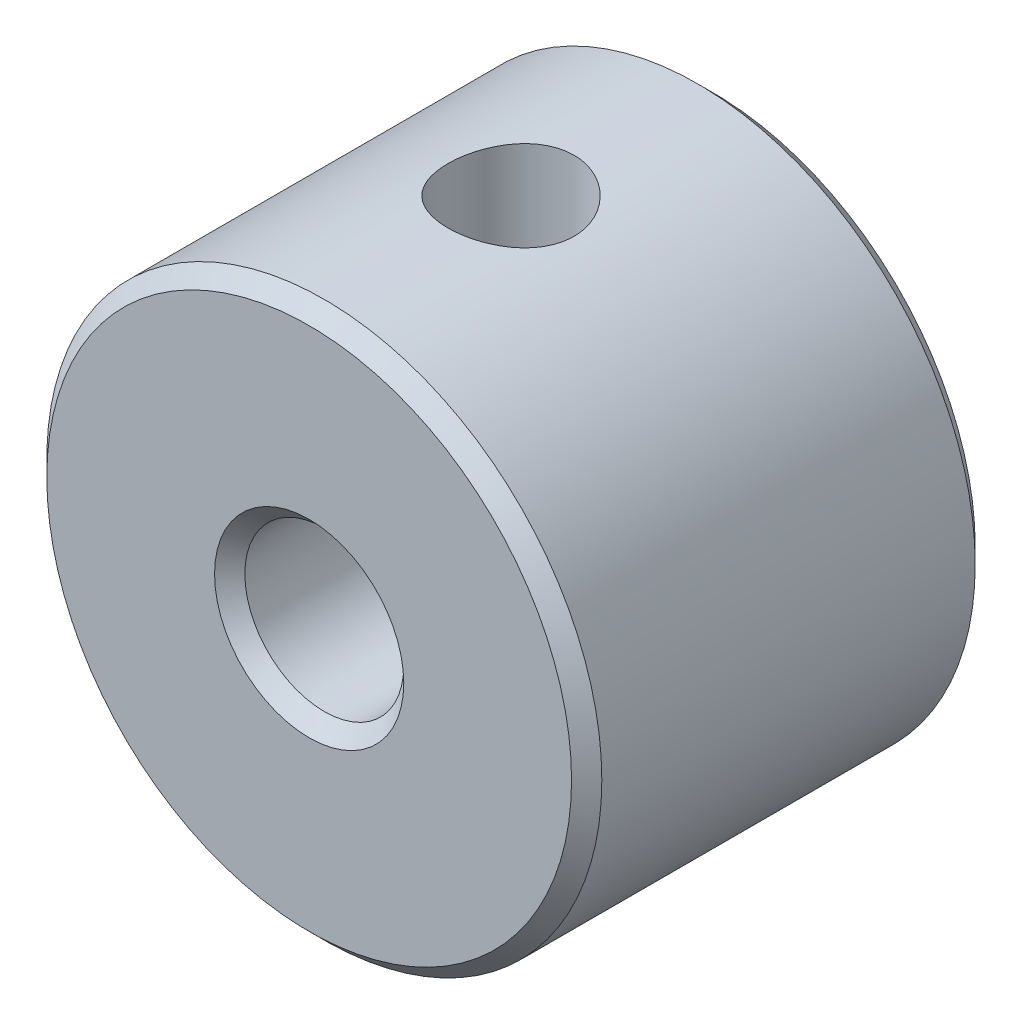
ISO-10303-21;
HEADER;
FILE_DESCRIPTION(('STEP AP214'),'2;1');
FILE_NAME('part.step','',(''),(''),'','','');
FILE_SCHEMA(('AUTOMOTIVE_DESIGN { 1 0 10303 214 1 1 1 1 }'));
ENDSEC;
DATA;
#1=APPLICATION_CONTEXT('core data for automotive mechanical design processes');
#2=APPLICATION_PROTOCOL_DEFINITION('international standard','automotive_design',2000,#1);
#3=PRODUCT_CONTEXT('',#1,'mechanical');
#4=PRODUCT('Part','Part','',(#3));
#5=PRODUCT_RELATED_PRODUCT_CATEGORY('part','',(#4));
#6=PRODUCT_DEFINITION_FORMATION('','',#4);
#7=PRODUCT_DEFINITION_CONTEXT('part definition',#1,'design');
#8=PRODUCT_DEFINITION('design','',#6,#7);
#9=PRODUCT_DEFINITION_SHAPE('','',#8);
#10=(LENGTH_UNIT() NAMED_UNIT(*) SI_UNIT(.MILLI.,.METRE.));
#11=(NAMED_UNIT(*) PLANE_ANGLE_UNIT() SI_UNIT($,.RADIAN.));
#12=(NAMED_UNIT(*) SI_UNIT($,.STERADIAN.) SOLID_ANGLE_UNIT());
#13=UNCERTAINTY_MEASURE_WITH_UNIT(LENGTH_MEASURE(1.E-05),#10,'distance_accuracy_value','');
#14=(GEOMETRIC_REPRESENTATION_CONTEXT(3) GLOBAL_UNCERTAINTY_ASSIGNED_CONTEXT((#13)) GLOBAL_UNIT_ASSIGNED_CONTEXT((#10,
#11,#12)) REPRESENTATION_CONTEXT('',''));
#15=CARTESIAN_POINT('',(0.,0.,0.));
#16=DIRECTION('',(0.,0.,1.));
#17=DIRECTION('',(1.,0.,0.));
#18=AXIS2_PLACEMENT_3D('',#15,#16,#17);
#19=CARTESIAN_POINT('',(0.,0.,8.));
#20=DIRECTION('',(0.,0.,-1.));
#21=DIRECTION('',(-1.,0.,0.));
#22=AXIS2_PLACEMENT_3D('',#19,#20,#21);
#23=CYLINDRICAL_SURFACE('',#22,5.5);
#24=CARTESIAN_POINT('',(0.,0.,0.300000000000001));
#25=DIRECTION('',(0.,0.,1.));
#26=DIRECTION('',(1.,0.,0.));
#27=AXIS2_PLACEMENT_3D('',#24,#25,#26);
#28=CIRCLE('',#27,5.5);
#29=CARTESIAN_POINT('',(5.5,0.,0.300000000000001));
#30=VERTEX_POINT('',#29);
#31=EDGE_CURVE('E41',#30,#30,#28,.T.);
#32=ORIENTED_EDGE('',*,*,#31,.T.);
#33=EDGE_LOOP('',(#32));
#34=FACE_BOUND('',#33,.T.);
#35=CARTESIAN_POINT('',(0.,0.,7.7));
#36=DIRECTION('',(0.,0.,1.));
#37=DIRECTION('',(1.,0.,0.));
#38=AXIS2_PLACEMENT_3D('',#35,#36,#37);
#39=CIRCLE('',#38,5.5);
#40=CARTESIAN_POINT('',(5.5,0.,7.7));
#41=VERTEX_POINT('',#40);
#42=EDGE_CURVE('E45',#41,#41,#39,.F.);
#43=ORIENTED_EDGE('',*,*,#42,.T.);
#44=EDGE_LOOP('',(#43));
#45=FACE_BOUND('',#44,.T.);
#46=CARTESIAN_POINT('',(0.,5.5,2.75));
#47=CARTESIAN_POINT('',(-0.0692591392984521,5.49999873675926,2.75000226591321));
#48=CARTESIAN_POINT('',(-0.138545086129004,5.49867854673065,2.75577561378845));
#49=CARTESIAN_POINT('',(-0.275144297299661,5.493539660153,2.77868973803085));
#50=CARTESIAN_POINT('',(-0.342456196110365,5.48971927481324,2.79583819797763));
#51=CARTESIAN_POINT('',(-0.473113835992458,5.48000476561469,2.84093402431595));
#52=CARTESIAN_POINT('',(-0.536463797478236,5.47411289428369,2.86886966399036));
#53=CARTESIAN_POINT('',(-0.657576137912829,5.46088910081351,2.93470855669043));
#54=CARTESIAN_POINT('',(-0.71533857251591,5.45355719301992,2.97261171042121));
#55=CARTESIAN_POINT('',(-0.824633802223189,5.4381132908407,3.05800102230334));
#56=CARTESIAN_POINT('',(-0.876056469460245,5.42999098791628,3.1056262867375));
#57=CARTESIAN_POINT('',(-0.970256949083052,5.41395325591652,3.20880948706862));
#58=CARTESIAN_POINT('',(-1.01303394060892,5.40603784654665,3.26436817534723));
#59=CARTESIAN_POINT('',(-1.08922299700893,5.39120791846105,3.38266602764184));
#60=CARTESIAN_POINT('',(-1.12251627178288,5.38430657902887,3.44548349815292));
#61=CARTESIAN_POINT('',(-1.17803034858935,5.37243480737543,3.57600475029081));
#62=CARTESIAN_POINT('',(-1.20025258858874,5.36746412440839,3.64370789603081));
#63=CARTESIAN_POINT('',(-1.23262674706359,5.36012172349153,3.78087959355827));
#64=CARTESIAN_POINT('',(-1.24297446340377,5.3577078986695,3.85029963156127));
#65=CARTESIAN_POINT('',(-1.25191494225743,5.35562617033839,3.98992911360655));
#66=CARTESIAN_POINT('',(-1.25050926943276,5.35595790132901,4.06013845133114));
#67=CARTESIAN_POINT('',(-1.23614008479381,5.35929175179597,4.19788644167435));
#68=CARTESIAN_POINT('',(-1.22340552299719,5.36224097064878,4.26545045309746));
#69=CARTESIAN_POINT('',(-1.18710342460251,5.37039368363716,4.39745724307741));
#70=CARTESIAN_POINT('',(-1.16353523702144,5.3755973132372,4.46189983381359));
#71=CARTESIAN_POINT('',(-1.10602867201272,5.38772371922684,4.58647033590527));
#72=CARTESIAN_POINT('',(-1.07200356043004,5.39466077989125,4.64655675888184));
#73=CARTESIAN_POINT('',(-0.994609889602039,5.40946384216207,4.76025127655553));
#74=CARTESIAN_POINT('',(-0.951239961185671,5.41732997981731,4.81385842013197));
#75=CARTESIAN_POINT('',(-0.855182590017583,5.43333076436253,4.91438928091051));
#76=CARTESIAN_POINT('',(-0.802300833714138,5.44146738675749,4.96112721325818));
#77=CARTESIAN_POINT('',(-0.689356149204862,5.45692512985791,5.04510294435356));
#78=CARTESIAN_POINT('',(-0.629293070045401,5.46424623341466,5.08234054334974));
#79=CARTESIAN_POINT('',(-0.503453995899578,5.47727487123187,5.14631019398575));
#80=CARTESIAN_POINT('',(-0.437664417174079,5.48297842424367,5.17301638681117));
#81=CARTESIAN_POINT('',(-0.302372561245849,5.49209994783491,5.21494200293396));
#82=CARTESIAN_POINT('',(-0.23287086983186,5.49551827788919,5.23016323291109));
#83=CARTESIAN_POINT('',(-0.0937199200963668,5.4996325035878,5.24841311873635));
#84=CARTESIAN_POINT('',(-0.0241055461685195,5.50038500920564,5.25169534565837));
#85=CARTESIAN_POINT('',(0.114676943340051,5.49924211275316,5.24666348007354));
#86=CARTESIAN_POINT('',(0.183845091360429,5.49734690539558,5.23835024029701));
#87=CARTESIAN_POINT('',(0.318920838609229,5.49115740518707,5.21057341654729));
#88=CARTESIAN_POINT('',(0.384857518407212,5.4868920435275,5.19124422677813));
#89=CARTESIAN_POINT('',(0.512551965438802,5.47644030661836,5.14213448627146));
#90=CARTESIAN_POINT('',(0.574309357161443,5.47025375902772,5.11235299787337));
#91=CARTESIAN_POINT('',(0.692930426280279,5.45650716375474,5.04266542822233));
#92=CARTESIAN_POINT('',(0.749705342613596,5.4489276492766,5.00261218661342));
#93=CARTESIAN_POINT('',(0.85581886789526,5.43327304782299,4.9137103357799));
#94=CARTESIAN_POINT('',(0.905156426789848,5.42519789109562,4.86486048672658));
#95=CARTESIAN_POINT('',(0.996008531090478,5.40926438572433,4.75858451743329));
#96=CARTESIAN_POINT('',(1.03734683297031,5.40141360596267,4.7010063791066));
#97=CARTESIAN_POINT('',(1.10976907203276,5.3870011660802,4.57957680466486));
#98=CARTESIAN_POINT('',(1.14085346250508,5.38043944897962,4.51572564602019));
#99=CARTESIAN_POINT('',(1.19166798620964,5.36941374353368,4.38390976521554));
#100=CARTESIAN_POINT('',(1.21146358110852,5.3649376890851,4.31597133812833));
#101=CARTESIAN_POINT('',(1.23932629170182,5.35857055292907,4.17761654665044));
#102=CARTESIAN_POINT('',(1.24739545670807,5.35667901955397,4.1072006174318));
#103=CARTESIAN_POINT('',(1.25148369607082,5.35572514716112,3.96767069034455));
#104=CARTESIAN_POINT('',(1.24778274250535,5.35659707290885,3.8985652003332));
#105=CARTESIAN_POINT('',(1.22906557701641,5.36092234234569,3.76199054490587));
#106=CARTESIAN_POINT('',(1.21404952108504,5.36437565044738,3.69452135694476));
#107=CARTESIAN_POINT('',(1.17326846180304,5.37344130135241,3.56337830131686));
#108=CARTESIAN_POINT('',(1.14754728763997,5.37904483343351,3.49969015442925));
#109=CARTESIAN_POINT('',(1.0861226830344,5.39178236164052,3.3774926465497));
#110=CARTESIAN_POINT('',(1.05041811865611,5.39891653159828,3.31898387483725));
#111=CARTESIAN_POINT('',(0.969124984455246,5.41410553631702,3.20743278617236));
#112=CARTESIAN_POINT('',(0.92333822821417,5.42217702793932,3.15453713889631));
#113=CARTESIAN_POINT('',(0.823578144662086,5.43822274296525,3.05708840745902));
#114=CARTESIAN_POINT('',(0.769602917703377,5.44619694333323,3.01253726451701));
#115=CARTESIAN_POINT('',(0.654070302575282,5.46128466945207,2.93243096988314));
#116=CARTESIAN_POINT('',(0.592415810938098,5.46838430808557,2.89701308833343));
#117=CARTESIAN_POINT('',(0.463877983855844,5.48078202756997,2.83710001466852));
#118=CARTESIAN_POINT('',(0.396998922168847,5.48608156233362,2.81259600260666));
#119=CARTESIAN_POINT('',(0.27508153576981,5.49337797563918,2.77938604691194));
#120=CARTESIAN_POINT('',(0.220684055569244,5.49584542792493,2.76838800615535));
#121=CARTESIAN_POINT('',(0.110863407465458,5.49915690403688,2.75369426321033));
#122=CARTESIAN_POINT('',(0.0554402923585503,5.50000101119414,2.74999818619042));
#123=CARTESIAN_POINT('',(0.,5.5,2.75));
#124=B_SPLINE_CURVE_WITH_KNOTS('',3,(#46,#47,#48,#49,#50,#51,#52,#53,#54,#55,#56,#57,#58,#59,
#60,#61,#62,#63,#64,#65,#66,#67,#68,#69,#70,#71,#72,#73,#74,#75,#76,#77,#78,#79,#80,#81,#82,#83,
#84,#85,#86,#87,#88,#89,#90,#91,#92,#93,#94,#95,#96,#97,#98,#99,#100,#101,#102,#103,#104,#105,
#106,#107,#108,#109,#110,#111,#112,#113,#114,#115,#116,#117,#118,#119,#120,#121,#122,#123),
.UNSPECIFIED.,.T.,.F.,(4,2,2,2,2,2,2,2,2,2,2,2,2,2,2,2,2,2,2,2,2,2,2,2,2,2,2,2,2,2,2,2,2,2,2,2,
2,2,4),(0.,0.207574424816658,0.415289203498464,0.622778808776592,0.830266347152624,
1.04096194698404,1.25167754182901,1.46492681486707,1.67814838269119,1.88780122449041,
2.09742615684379,2.30290857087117,2.50840333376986,2.71565078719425,2.92292862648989,
3.13505765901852,3.34719115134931,3.55984232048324,3.77246003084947,3.98053470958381,
4.18859408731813,4.39416788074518,4.59976012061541,4.80848064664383,5.01723061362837,
5.23015660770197,5.44307318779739,5.65474220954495,5.86637423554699,6.07301021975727,
6.27964335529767,6.48543868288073,6.69125739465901,6.90155512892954,7.11190172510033,
7.32524638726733,7.53841832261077,7.70458523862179,7.87074362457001),.UNSPECIFIED.);
#125=CARTESIAN_POINT('',(0.,5.5,2.75));
#126=VERTEX_POINT('',#125);
#127=EDGE_CURVE('E62',#126,#126,#124,.T.);
#128=ORIENTED_EDGE('',*,*,#127,.F.);
#129=EDGE_LOOP('',(#128));
#130=FACE_BOUND('',#129,.T.);
#131=ADVANCED_FACE('F30',(#34,#45,#130),#23,.T.);
#132=CARTESIAN_POINT('',(0.,0.,8.));
#133=DIRECTION('',(0.,0.,-1.));
#134=DIRECTION('',(-1.,0.,0.));
#135=AXIS2_PLACEMENT_3D('',#132,#133,#134);
#136=CYLINDRICAL_SURFACE('',#135,1.575);
#137=CARTESIAN_POINT('',(0.,0.,0.300000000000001));
#138=DIRECTION('',(0.,0.,1.));
#139=DIRECTION('',(1.,0.,0.));
#140=AXIS2_PLACEMENT_3D('',#137,#138,#139);
#141=CIRCLE('',#140,1.575);
#142=CARTESIAN_POINT('',(-1.575,0.,0.300000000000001));
#143=VERTEX_POINT('',#142);
#144=EDGE_CURVE('E50',#143,#143,#141,.F.);
#145=ORIENTED_EDGE('',*,*,#144,.T.);
#146=EDGE_LOOP('',(#145));
#147=FACE_BOUND('',#146,.T.);
#148=CARTESIAN_POINT('',(0.,0.,7.7));
#149=DIRECTION('',(0.,0.,1.));
#150=DIRECTION('',(1.,0.,0.));
#151=AXIS2_PLACEMENT_3D('',#148,#149,#150);
#152=CIRCLE('',#151,1.575);
#153=CARTESIAN_POINT('',(1.575,0.,7.7));
#154=VERTEX_POINT('',#153);
#155=EDGE_CURVE('E53',#154,#154,#152,.T.);
#156=ORIENTED_EDGE('',*,*,#155,.T.);
#157=EDGE_LOOP('',(#156));
#158=FACE_BOUND('',#157,.T.);
#159=CARTESIAN_POINT('',(0.,1.575,2.75));
#160=CARTESIAN_POINT('',(-0.0601456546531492,1.57499514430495,2.75000500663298));
#161=CARTESIAN_POINT('',(-0.120366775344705,1.5715198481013,2.75437623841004));
#162=CARTESIAN_POINT('',(-0.238868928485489,1.55792894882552,2.77156843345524));
#163=CARTESIAN_POINT('',(-0.297145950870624,1.54780041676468,2.78440584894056));
#164=CARTESIAN_POINT('',(-0.409732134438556,1.52186137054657,2.81761093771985));
#165=CARTESIAN_POINT('',(-0.464063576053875,1.50608633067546,2.83793161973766));
#166=CARTESIAN_POINT('',(-0.568128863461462,1.46999813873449,2.88510136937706));
#167=CARTESIAN_POINT('',(-0.617862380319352,1.44968466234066,2.91195090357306));
#168=CARTESIAN_POINT('',(-0.728490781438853,1.39814810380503,2.98146362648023));
#169=CARTESIAN_POINT('',(-0.787336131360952,1.36557643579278,3.02638900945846));
#170=CARTESIAN_POINT('',(-0.895456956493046,1.29726180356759,3.12477148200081));
#171=CARTESIAN_POINT('',(-0.944704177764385,1.2615099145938,3.17825294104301));
#172=CARTESIAN_POINT('',(-1.03397114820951,1.18947854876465,3.29372692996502));
#173=CARTESIAN_POINT('',(-1.07383930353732,1.15319931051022,3.35583644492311));
#174=CARTESIAN_POINT('',(-1.14271101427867,1.08497066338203,3.48791754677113));
#175=CARTESIAN_POINT('',(-1.17175150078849,1.05300677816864,3.5578613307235));
#176=CARTESIAN_POINT('',(-1.20774045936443,1.01114335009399,3.67462338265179));
#177=CARTESIAN_POINT('',(-1.21884620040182,0.997612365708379,3.71883754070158));
#178=CARTESIAN_POINT('',(-1.23624752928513,0.975966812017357,3.80944769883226));
#179=CARTESIAN_POINT('',(-1.24255479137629,0.967839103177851,3.85583811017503));
#180=CARTESIAN_POINT('',(-1.24990556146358,0.958333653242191,3.95014787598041));
#181=CARTESIAN_POINT('',(-1.25090571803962,0.957011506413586,3.99807661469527));
#182=CARTESIAN_POINT('',(-1.24741987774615,0.961547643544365,4.09340686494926));
#183=CARTESIAN_POINT('',(-1.2429287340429,0.967412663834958,4.14080783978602));
#184=CARTESIAN_POINT('',(-1.22769657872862,0.986688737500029,4.24138805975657));
#185=CARTESIAN_POINT('',(-1.21603575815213,1.00119797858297,4.29420748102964));
#186=CARTESIAN_POINT('',(-1.18672132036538,1.03577487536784,4.39626952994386));
#187=CARTESIAN_POINT('',(-1.16905031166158,1.05585863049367,4.44550126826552));
#188=CARTESIAN_POINT('',(-1.11882925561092,1.10938837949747,4.56256806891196));
#189=CARTESIAN_POINT('',(-1.08319226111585,1.14466968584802,4.62822918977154));
#190=CARTESIAN_POINT('',(-1.00146176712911,1.21683780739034,4.75170471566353));
#191=CARTESIAN_POINT('',(-0.955353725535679,1.25372679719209,4.80950802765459));
#192=CARTESIAN_POINT('',(-0.851744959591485,1.32636945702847,4.91803274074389));
#193=CARTESIAN_POINT('',(-0.794004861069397,1.36207696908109,4.96855885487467));
#194=CARTESIAN_POINT('',(-0.668220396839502,1.4279763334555,5.05922256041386));
#195=CARTESIAN_POINT('',(-0.600205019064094,1.45818319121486,5.09938854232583));
#196=CARTESIAN_POINT('',(-0.476201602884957,1.50228035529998,5.1571327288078));
#197=CARTESIAN_POINT('',(-0.422465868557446,1.51836116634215,5.17788288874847));
#198=CARTESIAN_POINT('',(-0.311376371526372,1.54496636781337,5.21198647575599));
#199=CARTESIAN_POINT('',(-0.254025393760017,1.55549497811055,5.22534552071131));
#200=CARTESIAN_POINT('',(-0.136906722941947,1.57015249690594,5.24389973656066));
#201=CARTESIAN_POINT('',(-0.0771287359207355,1.574250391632,5.24905534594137));
#202=CARTESIAN_POINT('',(0.0426225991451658,1.57556060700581,5.25070650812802));
#203=CARTESIAN_POINT('',(0.102595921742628,1.5727737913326,5.24720314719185));
#204=CARTESIAN_POINT('',(0.216301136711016,1.56104549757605,5.2323781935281));
#205=CARTESIAN_POINT('',(0.270164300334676,1.55258006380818,5.22166111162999));
#206=CARTESIAN_POINT('',(0.375066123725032,1.53062893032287,5.19363963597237));
#207=CARTESIAN_POINT('',(0.426103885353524,1.51714164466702,5.17633316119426));
#208=CARTESIAN_POINT('',(0.52783194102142,1.48494417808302,5.134515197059));
#209=CARTESIAN_POINT('',(0.57825623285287,1.46593826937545,5.10958958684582));
#210=CARTESIAN_POINT('',(0.674208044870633,1.42436158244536,5.05404930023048));
#211=CARTESIAN_POINT('',(0.71973548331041,1.40179074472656,5.0234345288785));
#212=CARTESIAN_POINT('',(0.813864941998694,1.34969205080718,4.95094591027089));
#213=CARTESIAN_POINT('',(0.861388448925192,1.31965937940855,4.90803858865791));
#214=CARTESIAN_POINT('',(0.949098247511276,1.25806014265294,4.81595039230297));
#215=CARTESIAN_POINT('',(0.989260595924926,1.22648898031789,4.76674989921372));
#216=CARTESIAN_POINT('',(1.04746730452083,1.1765504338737,4.68320914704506));
#217=CARTESIAN_POINT('',(1.0679641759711,1.15791508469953,4.65071980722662));
#218=CARTESIAN_POINT('',(1.10607386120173,1.1215713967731,4.58360536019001));
#219=CARTESIAN_POINT('',(1.123685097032,1.10386356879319,4.54897909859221));
#220=CARTESIAN_POINT('',(1.17180750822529,1.05338454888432,4.44208216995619));
#221=CARTESIAN_POINT('',(1.1978940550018,1.02299673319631,4.36638907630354));
#222=CARTESIAN_POINT('',(1.22671402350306,0.987958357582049,4.24411714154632));
#223=CARTESIAN_POINT('',(1.23466728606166,0.977907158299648,4.20031014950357));
#224=CARTESIAN_POINT('',(1.2458487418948,0.963623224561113,4.11120273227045));
#225=CARTESIAN_POINT('',(1.24908766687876,0.959377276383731,4.06590593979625));
#226=CARTESIAN_POINT('',(1.25057883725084,0.957434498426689,3.9749277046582));
#227=CARTESIAN_POINT('',(1.24881395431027,0.959760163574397,3.92924547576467));
#228=CARTESIAN_POINT('',(1.2404250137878,0.970573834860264,3.83904482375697));
#229=CARTESIAN_POINT('',(1.23379250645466,0.979072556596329,3.79452856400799));
#230=CARTESIAN_POINT('',(1.21320312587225,1.00454306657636,3.69319057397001));
#231=CARTESIAN_POINT('',(1.19754370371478,1.02339301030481,3.6372015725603));
#232=CARTESIAN_POINT('',(1.15953323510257,1.06626923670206,3.52961873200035));
#233=CARTESIAN_POINT('',(1.13716134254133,1.09031157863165,3.47803923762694));
#234=CARTESIAN_POINT('',(1.07612433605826,1.15113253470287,3.35925880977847));
#235=CARTESIAN_POINT('',(1.03452963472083,1.18912720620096,3.29418603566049));
#236=CARTESIAN_POINT('',(0.940208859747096,1.26503413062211,3.1727099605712));
#237=CARTESIAN_POINT('',(0.887486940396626,1.30294640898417,3.1163034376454));
#238=CARTESIAN_POINT('',(0.780749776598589,1.36905889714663,3.02166704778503));
#239=CARTESIAN_POINT('',(0.728390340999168,1.39782837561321,2.98197387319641));
#240=CARTESIAN_POINT('',(0.616388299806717,1.45069237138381,2.9105227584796));
#241=CARTESIAN_POINT('',(0.556755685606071,1.47479318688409,2.87875411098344));
#242=CARTESIAN_POINT('',(0.442026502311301,1.51269115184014,2.82939671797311));
#243=CARTESIAN_POINT('',(0.387928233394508,1.52754931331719,2.81030599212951));
#244=CARTESIAN_POINT('',(0.276494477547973,1.55158084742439,2.77960219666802));
#245=CARTESIAN_POINT('',(0.219166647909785,1.5607670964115,2.76797218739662));
#246=CARTESIAN_POINT('',(0.134434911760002,1.56948170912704,2.75695886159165));
#247=CARTESIAN_POINT('',(0.107663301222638,1.57154596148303,2.75435443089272));
#248=CARTESIAN_POINT('',(0.0539328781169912,1.57430633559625,2.75087370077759));
#249=CARTESIAN_POINT('',(0.0269740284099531,1.57500217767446,2.74999775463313));
#250=CARTESIAN_POINT('',(0.,1.575,2.75));
#251=B_SPLINE_CURVE_WITH_KNOTS('',3,(#159,#160,#161,#162,#163,#164,#165,#166,#167,#168,#169,
#170,#171,#172,#173,#174,#175,#176,#177,#178,#179,#180,#181,#182,#183,#184,#185,#186,#187,#188,
#189,#190,#191,#192,#193,#194,#195,#196,#197,#198,#199,#200,#201,#202,#203,#204,#205,#206,#207,
#208,#209,#210,#211,#212,#213,#214,#215,#216,#217,#218,#219,#220,#221,#222,#223,#224,#225,#226,
#227,#228,#229,#230,#231,#232,#233,#234,#235,#236,#237,#238,#239,#240,#241,#242,#243,#244,#245,
#246,#247,#248,#249,#250),.UNSPECIFIED.,.T.,.F.,(4,2,2,2,2,2,2,2,2,2,2,2,2,2,2,2,2,2,2,2,2,2,2,
2,2,2,2,2,2,2,2,2,2,2,2,2,2,2,2,2,2,2,2,2,2,4),(0.,0.180320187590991,0.360991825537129,
0.540547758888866,0.720116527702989,0.961486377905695,1.20355635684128,1.44930485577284,
1.69420731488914,1.8363970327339,1.97823970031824,2.12123925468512,2.2643729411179,
2.43145017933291,2.59901505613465,2.84559032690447,3.09251015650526,3.34515535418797,
3.59710067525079,3.77579715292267,3.95435761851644,4.13377661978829,4.31317311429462,
4.47914847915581,4.64517630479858,4.8226383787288,5.00010341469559,5.21152459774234,
5.42362170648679,5.5515513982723,5.6795508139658,5.93388886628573,6.07031033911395,
6.20642077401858,6.34299768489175,6.4798122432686,6.66213936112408,6.84503867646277,
7.10197385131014,7.35881326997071,7.5731773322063,7.7872501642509,7.96431112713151,
8.1409686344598,8.22182182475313,8.3026915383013),.UNSPECIFIED.);
#252=CARTESIAN_POINT('',(0.,1.575,2.75));
#253=VERTEX_POINT('',#252);
#254=EDGE_CURVE('E63',#253,#253,#251,.T.);
#255=ORIENTED_EDGE('',*,*,#254,.T.);
#256=EDGE_LOOP('',(#255));
#257=FACE_BOUND('',#256,.T.);
#258=ADVANCED_FACE('F73',(#147,#158,#257),#136,.F.);
#259=CARTESIAN_POINT('',(0.,0.,8.));
#260=DIRECTION('',(0.,0.,1.));
#261=DIRECTION('',(1.,0.,0.));
#262=AXIS2_PLACEMENT_3D('',#259,#260,#261);
#263=PLANE('',#262);
#264=CARTESIAN_POINT('',(0.,0.,8.));
#265=DIRECTION('',(0.,0.,1.));
#266=DIRECTION('',(1.,0.,0.));
#267=AXIS2_PLACEMENT_3D('',#264,#265,#266);
#268=CIRCLE('',#267,1.875);
#269=CARTESIAN_POINT('',(1.875,0.,8.));
#270=VERTEX_POINT('',#269);
#271=EDGE_CURVE('E10',#270,#270,#268,.F.);
#272=ORIENTED_EDGE('',*,*,#271,.T.);
#273=EDGE_LOOP('',(#272));
#274=FACE_BOUND('',#273,.T.);
#275=CARTESIAN_POINT('',(0.,0.,8.));
#276=DIRECTION('',(0.,0.,1.));
#277=DIRECTION('',(1.,0.,0.));
#278=AXIS2_PLACEMENT_3D('',#275,#276,#277);
#279=CIRCLE('',#278,5.2);
#280=CARTESIAN_POINT('',(5.2,0.,8.));
#281=VERTEX_POINT('',#280);
#282=EDGE_CURVE('E37',#281,#281,#279,.T.);
#283=ORIENTED_EDGE('',*,*,#282,.T.);
#284=EDGE_LOOP('',(#283));
#285=FACE_BOUND('',#284,.T.);
#286=ADVANCED_FACE('F90',(#274,#285),#263,.T.);
#287=CARTESIAN_POINT('',(0.,0.,0.));
#288=DIRECTION('',(0.,0.,1.));
#289=DIRECTION('',(1.,0.,0.));
#290=AXIS2_PLACEMENT_3D('',#287,#288,#289);
#291=PLANE('',#290);
#292=CARTESIAN_POINT('',(0.,0.,0.));
#293=DIRECTION('',(0.,0.,1.));
#294=DIRECTION('',(1.,0.,0.));
#295=AXIS2_PLACEMENT_3D('',#292,#293,#294);
#296=CIRCLE('',#295,1.875);
#297=CARTESIAN_POINT('',(-1.875,0.,0.));
#298=VERTEX_POINT('',#297);
#299=EDGE_CURVE('E56',#298,#298,#296,.T.);
#300=ORIENTED_EDGE('',*,*,#299,.T.);
#301=EDGE_LOOP('',(#300));
#302=FACE_BOUND('',#301,.T.);
#303=CARTESIAN_POINT('',(0.,0.,0.));
#304=DIRECTION('',(0.,0.,1.));
#305=DIRECTION('',(1.,0.,0.));
#306=AXIS2_PLACEMENT_3D('',#303,#304,#305);
#307=CIRCLE('',#306,5.2);
#308=CARTESIAN_POINT('',(5.2,0.,0.));
#309=VERTEX_POINT('',#308);
#310=EDGE_CURVE('E59',#309,#309,#307,.F.);
#311=ORIENTED_EDGE('',*,*,#310,.T.);
#312=EDGE_LOOP('',(#311));
#313=FACE_BOUND('',#312,.T.);
#314=ADVANCED_FACE('F80',(#302,#313),#291,.F.);
#315=CARTESIAN_POINT('',(0.,8.,4.));
#316=DIRECTION('',(0.,-1.,0.));
#317=DIRECTION('',(0.,0.,-1.));
#318=AXIS2_PLACEMENT_3D('',#315,#316,#317);
#319=CYLINDRICAL_SURFACE('',#318,1.25);
#320=ORIENTED_EDGE('',*,*,#254,.F.);
#321=EDGE_LOOP('',(#320));
#322=FACE_BOUND('',#321,.T.);
#323=ORIENTED_EDGE('',*,*,#127,.T.);
#324=EDGE_LOOP('',(#323));
#325=FACE_BOUND('',#324,.T.);
#326=ADVANCED_FACE('F76',(#322,#325),#319,.F.);
#327=CARTESIAN_POINT('',(0.,0.,0.));
#328=DIRECTION('',(0.,0.,-1.));
#329=DIRECTION('',(-1.,0.,0.));
#330=AXIS2_PLACEMENT_3D('',#327,#328,#329);
#331=CONICAL_SURFACE('',#330,1.875,0.785398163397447);
#332=CARTESIAN_POINT('',(-1.575,0.,0.300000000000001));
#333=CARTESIAN_POINT('',(-1.578125,0.,0.296875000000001));
#334=CARTESIAN_POINT('',(-1.58125,0.,0.293750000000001));
#335=CARTESIAN_POINT('',(-1.5875,0.,0.287500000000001));
#336=CARTESIAN_POINT('',(-1.590625,0.,0.284375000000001));
#337=CARTESIAN_POINT('',(-1.596875,0.,0.278125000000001));
#338=CARTESIAN_POINT('',(-1.6,0.,0.275000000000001));
#339=CARTESIAN_POINT('',(-1.60625,0.,0.268750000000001));
#340=CARTESIAN_POINT('',(-1.609375,0.,0.265625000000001));
#341=CARTESIAN_POINT('',(-1.615625,0.,0.259375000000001));
#342=CARTESIAN_POINT('',(-1.61875,0.,0.256250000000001));
#343=CARTESIAN_POINT('',(-1.625,0.,0.250000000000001));
#344=CARTESIAN_POINT('',(-1.628125,0.,0.246875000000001));
#345=CARTESIAN_POINT('',(-1.634375,0.,0.240625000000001));
#346=CARTESIAN_POINT('',(-1.6375,0.,0.237500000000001));
#347=CARTESIAN_POINT('',(-1.64375,0.,0.231250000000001));
#348=CARTESIAN_POINT('',(-1.646875,0.,0.228125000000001));
#349=CARTESIAN_POINT('',(-1.653125,0.,0.221875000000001));
#350=CARTESIAN_POINT('',(-1.65625,0.,0.218750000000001));
#351=CARTESIAN_POINT('',(-1.6625,0.,0.212500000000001));
#352=CARTESIAN_POINT('',(-1.665625,0.,0.209375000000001));
#353=CARTESIAN_POINT('',(-1.671875,0.,0.203125));
#354=CARTESIAN_POINT('',(-1.675,0.,0.200000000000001));
#355=CARTESIAN_POINT('',(-1.68125,0.,0.19375));
#356=CARTESIAN_POINT('',(-1.684375,0.,0.190625));
#357=CARTESIAN_POINT('',(-1.690625,0.,0.184375));
#358=CARTESIAN_POINT('',(-1.69375,0.,0.18125));
#359=CARTESIAN_POINT('',(-1.7,0.,0.175));
#360=CARTESIAN_POINT('',(-1.703125,0.,0.171875));
#361=CARTESIAN_POINT('',(-1.709375,0.,0.165625));
#362=CARTESIAN_POINT('',(-1.7125,0.,0.1625));
#363=CARTESIAN_POINT('',(-1.71875,0.,0.15625));
#364=CARTESIAN_POINT('',(-1.721875,0.,0.153125));
#365=CARTESIAN_POINT('',(-1.728125,0.,0.146875));
#366=CARTESIAN_POINT('',(-1.73125,0.,0.14375));
#367=CARTESIAN_POINT('',(-1.7375,0.,0.1375));
#368=CARTESIAN_POINT('',(-1.740625,0.,0.134375));
#369=CARTESIAN_POINT('',(-1.746875,0.,0.128125));
#370=CARTESIAN_POINT('',(-1.75,0.,0.125));
#371=CARTESIAN_POINT('',(-1.75625,0.,0.11875));
#372=CARTESIAN_POINT('',(-1.759375,0.,0.115625));
#373=CARTESIAN_POINT('',(-1.765625,0.,0.109375));
#374=CARTESIAN_POINT('',(-1.76875,0.,0.10625));
#375=CARTESIAN_POINT('',(-1.775,0.,0.1));
#376=CARTESIAN_POINT('',(-1.778125,0.,0.0968750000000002));
#377=CARTESIAN_POINT('',(-1.784375,0.,0.0906250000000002));
#378=CARTESIAN_POINT('',(-1.7875,0.,0.0875000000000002));
#379=CARTESIAN_POINT('',(-1.79375,0.,0.0812500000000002));
#380=CARTESIAN_POINT('',(-1.796875,0.,0.0781250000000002));
#381=CARTESIAN_POINT('',(-1.803125,0.,0.0718750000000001));
#382=CARTESIAN_POINT('',(-1.80625,0.,0.0687500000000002));
#383=CARTESIAN_POINT('',(-1.8125,0.,0.0625000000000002));
#384=CARTESIAN_POINT('',(-1.815625,0.,0.0593750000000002));
#385=CARTESIAN_POINT('',(-1.821875,0.,0.0531250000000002));
#386=CARTESIAN_POINT('',(-1.825,0.,0.0500000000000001));
#387=CARTESIAN_POINT('',(-1.83125,0.,0.0437500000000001));
#388=CARTESIAN_POINT('',(-1.834375,0.,0.0406250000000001));
#389=CARTESIAN_POINT('',(-1.840625,0.,0.0343750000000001));
#390=CARTESIAN_POINT('',(-1.84375,0.,0.03125));
#391=CARTESIAN_POINT('',(-1.85,0.,0.025));
#392=CARTESIAN_POINT('',(-1.853125,0.,0.0218750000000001));
#393=CARTESIAN_POINT('',(-1.859375,0.,0.0156250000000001));
#394=CARTESIAN_POINT('',(-1.8625,0.,0.0125000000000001));
#395=CARTESIAN_POINT('',(-1.86875,0.,0.00625));
#396=CARTESIAN_POINT('',(-1.871875,0.,0.00312499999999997));
#397=CARTESIAN_POINT('',(-1.875,0.,0.));
#398=B_SPLINE_CURVE_WITH_KNOTS('',3,(#332,#333,#334,#335,#336,#337,#338,#339,#340,#341,#342,
#343,#344,#345,#346,#347,#348,#349,#350,#351,#352,#353,#354,#355,#356,#357,#358,#359,#360,#361,
#362,#363,#364,#365,#366,#367,#368,#369,#370,#371,#372,#373,#374,#375,#376,#377,#378,#379,#380,
#381,#382,#383,#384,#385,#386,#387,#388,#389,#390,#391,#392,#393,#394,#395,#396,#397),
.UNSPECIFIED.,.F.,.F.,(4,2,2,2,2,2,2,2,2,2,2,2,2,2,2,2,2,2,2,2,2,2,2,2,2,2,2,2,2,2,2,2,4),(0.,
0.0132582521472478,0.0265165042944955,0.0397747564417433,0.0530330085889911,0.066291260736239,
0.0795495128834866,0.0928077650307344,0.106066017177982,0.11932426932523,0.132582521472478,
0.145840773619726,0.159099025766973,0.172357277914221,0.185615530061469,0.198873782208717,
0.212132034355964,0.225390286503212,0.23864853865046,0.251906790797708,0.265165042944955,
0.278423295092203,0.291681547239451,0.304939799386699,0.318198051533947,0.331456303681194,
0.344714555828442,0.35797280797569,0.371231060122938,0.384489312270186,0.397747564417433,
0.411005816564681,0.424264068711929),.UNSPECIFIED.);
#399=EDGE_CURVE('BSEAM79',#143,#298,#398,.T.);
#400=ORIENTED_EDGE('',*,*,#144,.F.);
#401=ORIENTED_EDGE('',*,*,#299,.F.);
#402=ORIENTED_EDGE('',*,*,#399,.T.);
#403=ORIENTED_EDGE('',*,*,#399,.F.);
#404=EDGE_LOOP('',(#400,#402,#401,#403));
#405=FACE_BOUND('',#404,.T.);
#406=ADVANCED_FACE('F79',(#405),#331,.F.);
#407=CARTESIAN_POINT('',(0.,0.,0.300000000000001));
#408=DIRECTION('',(0.,0.,1.));
#409=DIRECTION('',(1.,0.,0.));
#410=AXIS2_PLACEMENT_3D('',#407,#408,#409);
#411=CONICAL_SURFACE('',#410,5.5,0.78539816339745);
#412=CARTESIAN_POINT('',(5.2,0.,0.));
#413=CARTESIAN_POINT('',(5.203125,0.,0.00312499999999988));
#414=CARTESIAN_POINT('',(5.20625,0.,0.00624999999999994));
#415=CARTESIAN_POINT('',(5.2125,0.,0.0125));
#416=CARTESIAN_POINT('',(5.215625,0.,0.0156250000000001));
#417=CARTESIAN_POINT('',(5.221875,0.,0.0218750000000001));
#418=CARTESIAN_POINT('',(5.225,0.,0.025));
#419=CARTESIAN_POINT('',(5.23125,0.,0.03125));
#420=CARTESIAN_POINT('',(5.234375,0.,0.034375));
#421=CARTESIAN_POINT('',(5.240625,0.,0.0406250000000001));
#422=CARTESIAN_POINT('',(5.24375,0.,0.0437500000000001));
#423=CARTESIAN_POINT('',(5.25,0.,0.0500000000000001));
#424=CARTESIAN_POINT('',(5.253125,0.,0.0531250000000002));
#425=CARTESIAN_POINT('',(5.259375,0.,0.0593750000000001));
#426=CARTESIAN_POINT('',(5.2625,0.,0.0625000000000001));
#427=CARTESIAN_POINT('',(5.26875,0.,0.06875));
#428=CARTESIAN_POINT('',(5.271875,0.,0.0718750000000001));
#429=CARTESIAN_POINT('',(5.278125,0.,0.0781250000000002));
#430=CARTESIAN_POINT('',(5.28125,0.,0.0812500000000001));
#431=CARTESIAN_POINT('',(5.2875,0.,0.0875000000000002));
#432=CARTESIAN_POINT('',(5.290625,0.,0.0906250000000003));
#433=CARTESIAN_POINT('',(5.296875,0.,0.0968750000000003));
#434=CARTESIAN_POINT('',(5.3,0.,0.1));
#435=CARTESIAN_POINT('',(5.30625,0.,0.10625));
#436=CARTESIAN_POINT('',(5.309375,0.,0.109375));
#437=CARTESIAN_POINT('',(5.315625,0.,0.115625));
#438=CARTESIAN_POINT('',(5.31875,0.,0.11875));
#439=CARTESIAN_POINT('',(5.325,0.,0.125));
#440=CARTESIAN_POINT('',(5.328125,0.,0.128125));
#441=CARTESIAN_POINT('',(5.334375,0.,0.134375));
#442=CARTESIAN_POINT('',(5.3375,0.,0.1375));
#443=CARTESIAN_POINT('',(5.34375,0.,0.14375));
#444=CARTESIAN_POINT('',(5.346875,0.,0.146875));
#445=CARTESIAN_POINT('',(5.353125,0.,0.153125));
#446=CARTESIAN_POINT('',(5.35625,0.,0.15625));
#447=CARTESIAN_POINT('',(5.3625,0.,0.1625));
#448=CARTESIAN_POINT('',(5.365625,0.,0.165625));
#449=CARTESIAN_POINT('',(5.371875,0.,0.171875));
#450=CARTESIAN_POINT('',(5.375,0.,0.175));
#451=CARTESIAN_POINT('',(5.38125,0.,0.18125));
#452=CARTESIAN_POINT('',(5.384375,0.,0.184375));
#453=CARTESIAN_POINT('',(5.390625,0.,0.190625));
#454=CARTESIAN_POINT('',(5.39375,0.,0.19375));
#455=CARTESIAN_POINT('',(5.4,0.,0.200000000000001));
#456=CARTESIAN_POINT('',(5.403125,0.,0.203125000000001));
#457=CARTESIAN_POINT('',(5.409375,0.,0.209375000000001));
#458=CARTESIAN_POINT('',(5.4125,0.,0.2125));
#459=CARTESIAN_POINT('',(5.41875,0.,0.21875));
#460=CARTESIAN_POINT('',(5.421875,0.,0.221875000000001));
#461=CARTESIAN_POINT('',(5.428125,0.,0.228125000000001));
#462=CARTESIAN_POINT('',(5.43125,0.,0.231250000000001));
#463=CARTESIAN_POINT('',(5.4375,0.,0.237500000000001));
#464=CARTESIAN_POINT('',(5.440625,0.,0.240625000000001));
#465=CARTESIAN_POINT('',(5.446875,0.,0.246875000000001));
#466=CARTESIAN_POINT('',(5.45,0.,0.250000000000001));
#467=CARTESIAN_POINT('',(5.45625,0.,0.256250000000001));
#468=CARTESIAN_POINT('',(5.459375,0.,0.259375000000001));
#469=CARTESIAN_POINT('',(5.465625,0.,0.265625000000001));
#470=CARTESIAN_POINT('',(5.46875,0.,0.268750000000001));
#471=CARTESIAN_POINT('',(5.475,0.,0.275000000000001));
#472=CARTESIAN_POINT('',(5.478125,0.,0.278125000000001));
#473=CARTESIAN_POINT('',(5.484375,0.,0.284375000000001));
#474=CARTESIAN_POINT('',(5.4875,0.,0.287500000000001));
#475=CARTESIAN_POINT('',(5.49375,0.,0.293750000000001));
#476=CARTESIAN_POINT('',(5.496875,0.,0.296875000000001));
#477=CARTESIAN_POINT('',(5.5,0.,0.300000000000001));
#478=B_SPLINE_CURVE_WITH_KNOTS('',3,(#412,#413,#414,#415,#416,#417,#418,#419,#420,#421,#422,
#423,#424,#425,#426,#427,#428,#429,#430,#431,#432,#433,#434,#435,#436,#437,#438,#439,#440,#441,
#442,#443,#444,#445,#446,#447,#448,#449,#450,#451,#452,#453,#454,#455,#456,#457,#458,#459,#460,
#461,#462,#463,#464,#465,#466,#467,#468,#469,#470,#471,#472,#473,#474,#475,#476,#477),
.UNSPECIFIED.,.F.,.F.,(4,2,2,2,2,2,2,2,2,2,2,2,2,2,2,2,2,2,2,2,2,2,2,2,2,2,2,2,2,2,2,2,4),(0.,
0.0132582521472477,0.0265165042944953,0.0397747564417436,0.0530330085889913,0.066291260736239,
0.0795495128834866,0.0928077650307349,0.106066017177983,0.11932426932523,0.132582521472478,
0.145840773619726,0.159099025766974,0.172357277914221,0.185615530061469,0.198873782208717,
0.212132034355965,0.225390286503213,0.23864853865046,0.251906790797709,0.265165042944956,
0.278423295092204,0.291681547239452,0.3049397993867,0.318198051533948,0.331456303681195,
0.344714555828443,0.357972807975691,0.371231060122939,0.384489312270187,0.397747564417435,
0.411005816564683,0.42426406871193),.UNSPECIFIED.);
#479=EDGE_CURVE('BSEAM87',#309,#30,#478,.T.);
#480=ORIENTED_EDGE('',*,*,#310,.F.);
#481=ORIENTED_EDGE('',*,*,#31,.F.);
#482=ORIENTED_EDGE('',*,*,#479,.T.);
#483=ORIENTED_EDGE('',*,*,#479,.F.);
#484=EDGE_LOOP('',(#480,#482,#481,#483));
#485=FACE_BOUND('',#484,.T.);
#486=ADVANCED_FACE('F87',(#485),#411,.T.);
#487=CARTESIAN_POINT('',(0.,0.,7.7));
#488=DIRECTION('',(0.,0.,1.));
#489=DIRECTION('',(1.,0.,0.));
#490=AXIS2_PLACEMENT_3D('',#487,#488,#489);
#491=CONICAL_SURFACE('',#490,1.575,0.785398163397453);
#492=CARTESIAN_POINT('',(1.875,0.,8.));
#493=CARTESIAN_POINT('',(1.871875,0.,7.996875));
#494=CARTESIAN_POINT('',(1.86875,0.,7.99375));
#495=CARTESIAN_POINT('',(1.8625,0.,7.9875));
#496=CARTESIAN_POINT('',(1.859375,0.,7.984375));
#497=CARTESIAN_POINT('',(1.853125,0.,7.978125));
#498=CARTESIAN_POINT('',(1.85,0.,7.975));
#499=CARTESIAN_POINT('',(1.84375,0.,7.96875));
#500=CARTESIAN_POINT('',(1.840625,0.,7.965625));
#501=CARTESIAN_POINT('',(1.834375,0.,7.959375));
#502=CARTESIAN_POINT('',(1.83125,0.,7.95625));
#503=CARTESIAN_POINT('',(1.825,0.,7.95));
#504=CARTESIAN_POINT('',(1.821875,0.,7.946875));
#505=CARTESIAN_POINT('',(1.815625,0.,7.940625));
#506=CARTESIAN_POINT('',(1.8125,0.,7.9375));
#507=CARTESIAN_POINT('',(1.80625,0.,7.93125));
#508=CARTESIAN_POINT('',(1.803125,0.,7.928125));
#509=CARTESIAN_POINT('',(1.796875,0.,7.921875));
#510=CARTESIAN_POINT('',(1.79375,0.,7.91875));
#511=CARTESIAN_POINT('',(1.7875,0.,7.9125));
#512=CARTESIAN_POINT('',(1.784375,0.,7.909375));
#513=CARTESIAN_POINT('',(1.778125,0.,7.903125));
#514=CARTESIAN_POINT('',(1.775,0.,7.9));
#515=CARTESIAN_POINT('',(1.76875,0.,7.89375));
#516=CARTESIAN_POINT('',(1.765625,0.,7.890625));
#517=CARTESIAN_POINT('',(1.759375,0.,7.884375));
#518=CARTESIAN_POINT('',(1.75625,0.,7.88125));
#519=CARTESIAN_POINT('',(1.75,0.,7.875));
#520=CARTESIAN_POINT('',(1.746875,0.,7.871875));
#521=CARTESIAN_POINT('',(1.740625,0.,7.865625));
#522=CARTESIAN_POINT('',(1.7375,0.,7.8625));
#523=CARTESIAN_POINT('',(1.73125,0.,7.85625));
#524=CARTESIAN_POINT('',(1.728125,0.,7.853125));
#525=CARTESIAN_POINT('',(1.721875,0.,7.846875));
#526=CARTESIAN_POINT('',(1.71875,0.,7.84375));
#527=CARTESIAN_POINT('',(1.7125,0.,7.8375));
#528=CARTESIAN_POINT('',(1.709375,0.,7.834375));
#529=CARTESIAN_POINT('',(1.703125,0.,7.828125));
#530=CARTESIAN_POINT('',(1.7,0.,7.825));
#531=CARTESIAN_POINT('',(1.69375,0.,7.81875));
#532=CARTESIAN_POINT('',(1.690625,0.,7.815625));
#533=CARTESIAN_POINT('',(1.684375,0.,7.809375));
#534=CARTESIAN_POINT('',(1.68125,0.,7.80625));
#535=CARTESIAN_POINT('',(1.675,0.,7.8));
#536=CARTESIAN_POINT('',(1.671875,0.,7.796875));
#537=CARTESIAN_POINT('',(1.665625,0.,7.790625));
#538=CARTESIAN_POINT('',(1.6625,0.,7.7875));
#539=CARTESIAN_POINT('',(1.65625,0.,7.78125));
#540=CARTESIAN_POINT('',(1.653125,0.,7.778125));
#541=CARTESIAN_POINT('',(1.646875,0.,7.771875));
#542=CARTESIAN_POINT('',(1.64375,0.,7.76875));
#543=CARTESIAN_POINT('',(1.6375,0.,7.7625));
#544=CARTESIAN_POINT('',(1.634375,0.,7.759375));
#545=CARTESIAN_POINT('',(1.628125,0.,7.753125));
#546=CARTESIAN_POINT('',(1.625,0.,7.75));
#547=CARTESIAN_POINT('',(1.61875,0.,7.74375));
#548=CARTESIAN_POINT('',(1.615625,0.,7.740625));
#549=CARTESIAN_POINT('',(1.609375,0.,7.734375));
#550=CARTESIAN_POINT('',(1.60625,0.,7.73125));
#551=CARTESIAN_POINT('',(1.6,0.,7.725));
#552=CARTESIAN_POINT('',(1.596875,0.,7.721875));
#553=CARTESIAN_POINT('',(1.590625,0.,7.715625));
#554=CARTESIAN_POINT('',(1.5875,0.,7.7125));
#555=CARTESIAN_POINT('',(1.58125,0.,7.70625));
#556=CARTESIAN_POINT('',(1.578125,0.,7.703125));
#557=CARTESIAN_POINT('',(1.575,0.,7.7));
#558=B_SPLINE_CURVE_WITH_KNOTS('',3,(#492,#493,#494,#495,#496,#497,#498,#499,#500,#501,#502,
#503,#504,#505,#506,#507,#508,#509,#510,#511,#512,#513,#514,#515,#516,#517,#518,#519,#520,#521,
#522,#523,#524,#525,#526,#527,#528,#529,#530,#531,#532,#533,#534,#535,#536,#537,#538,#539,#540,
#541,#542,#543,#544,#545,#546,#547,#548,#549,#550,#551,#552,#553,#554,#555,#556,#557),
.UNSPECIFIED.,.F.,.F.,(4,2,2,2,2,2,2,2,2,2,2,2,2,2,2,2,2,2,2,2,2,2,2,2,2,2,2,2,2,2,2,2,4),(0.,
0.0132582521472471,0.0265165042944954,0.0397747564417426,0.0530330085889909,0.0662912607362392,
0.0795495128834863,0.0928077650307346,0.106066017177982,0.11932426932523,0.132582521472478,
0.145840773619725,0.159099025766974,0.172357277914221,0.185615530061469,0.198873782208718,
0.212132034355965,0.225390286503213,0.23864853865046,0.251906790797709,0.265165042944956,
0.278423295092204,0.291681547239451,0.3049397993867,0.318198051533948,0.331456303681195,
0.344714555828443,0.357972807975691,0.371231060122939,0.384489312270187,0.397747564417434,
0.411005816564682,0.42426406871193),.UNSPECIFIED.);
#559=EDGE_CURVE('BSEAM105',#270,#154,#558,.T.);
#560=ORIENTED_EDGE('',*,*,#271,.F.);
#561=ORIENTED_EDGE('',*,*,#155,.F.);
#562=ORIENTED_EDGE('',*,*,#559,.T.);
#563=ORIENTED_EDGE('',*,*,#559,.F.);
#564=EDGE_LOOP('',(#560,#562,#561,#563));
#565=FACE_BOUND('',#564,.T.);
#566=ADVANCED_FACE('F105',(#565),#491,.F.);
#567=CARTESIAN_POINT('',(0.,0.,8.));
#568=DIRECTION('',(0.,0.,-1.));
#569=DIRECTION('',(-1.,0.,0.));
#570=AXIS2_PLACEMENT_3D('',#567,#568,#569);
#571=CONICAL_SURFACE('',#570,5.2,0.785398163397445);
#572=ORIENTED_EDGE('',*,*,#42,.F.);
#573=EDGE_LOOP('',(#572));
#574=FACE_BOUND('',#573,.T.);
#575=ORIENTED_EDGE('',*,*,#282,.F.);
#576=EDGE_LOOP('',(#575));
#577=FACE_BOUND('',#576,.T.);
#578=ADVANCED_FACE('F32',(#574,#577),#571,.T.);
#579=CLOSED_SHELL('',(#131,#258,#286,#314,#326,#406,#486,#566,#578));
#580=MANIFOLD_SOLID_BREP('B2',#579);
#581=ADVANCED_BREP_SHAPE_REPRESENTATION('',(#18,#580),#14);
#582=SHAPE_DEFINITION_REPRESENTATION(#9,#581);
ENDSEC;
END-ISO-10303-21;
